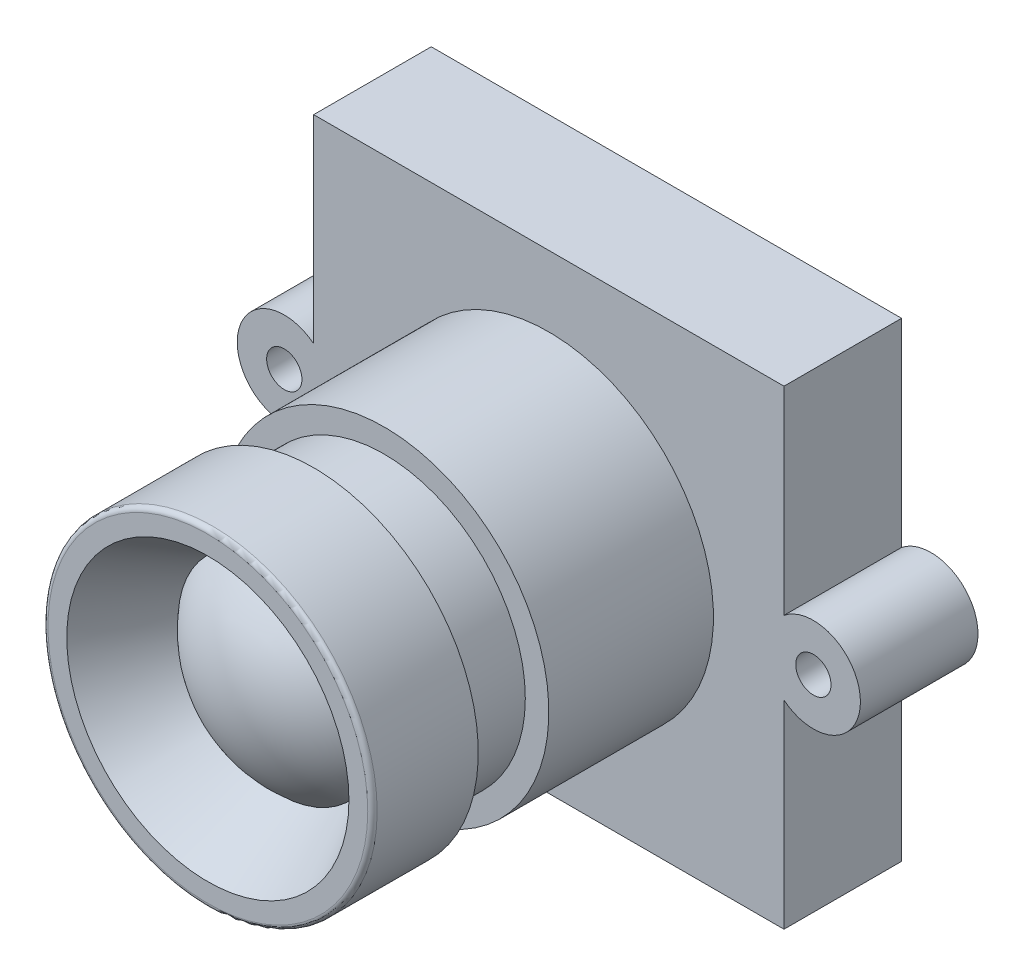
ISO-10303-21;
HEADER;
FILE_DESCRIPTION(('STEP AP214'),'2;1');
FILE_NAME('part.step','',(''),(''),'','','');
FILE_SCHEMA(('AUTOMOTIVE_DESIGN { 1 0 10303 214 1 1 1 1 }'));
ENDSEC;
DATA;
#1=APPLICATION_CONTEXT('core data for automotive mechanical design processes');
#2=APPLICATION_PROTOCOL_DEFINITION('international standard','automotive_design',2000,#1);
#3=PRODUCT_CONTEXT('',#1,'mechanical');
#4=PRODUCT('Part','Part','',(#3));
#5=PRODUCT_RELATED_PRODUCT_CATEGORY('part','',(#4));
#6=PRODUCT_DEFINITION_FORMATION('','',#4);
#7=PRODUCT_DEFINITION_CONTEXT('part definition',#1,'design');
#8=PRODUCT_DEFINITION('design','',#6,#7);
#9=PRODUCT_DEFINITION_SHAPE('','',#8);
#10=(LENGTH_UNIT() NAMED_UNIT(*) SI_UNIT(.MILLI.,.METRE.));
#11=(NAMED_UNIT(*) PLANE_ANGLE_UNIT() SI_UNIT($,.RADIAN.));
#12=(NAMED_UNIT(*) SI_UNIT($,.STERADIAN.) SOLID_ANGLE_UNIT());
#13=UNCERTAINTY_MEASURE_WITH_UNIT(LENGTH_MEASURE(1.E-05),#10,'distance_accuracy_value','');
#14=(GEOMETRIC_REPRESENTATION_CONTEXT(3) GLOBAL_UNCERTAINTY_ASSIGNED_CONTEXT((#13)) GLOBAL_UNIT_ASSIGNED_CONTEXT((#10,
#11,#12)) REPRESENTATION_CONTEXT('',''));
#15=CARTESIAN_POINT('',(0.,0.,0.));
#16=DIRECTION('',(0.,0.,1.));
#17=DIRECTION('',(1.,0.,0.));
#18=AXIS2_PLACEMENT_3D('',#15,#16,#17);
#19=CARTESIAN_POINT('',(-10.,-10.,5.));
#20=DIRECTION('',(0.,0.,1.));
#21=DIRECTION('',(1.,0.,0.));
#22=AXIS2_PLACEMENT_3D('',#19,#20,#21);
#23=PLANE('',#22);
#24=CARTESIAN_POINT('',(0.,0.,5.));
#25=DIRECTION('',(0.,0.,1.));
#26=DIRECTION('',(1.,0.,0.));
#27=AXIS2_PLACEMENT_3D('',#24,#25,#26);
#28=CIRCLE('',#27,6.5);
#29=CARTESIAN_POINT('',(6.5,0.,5.));
#30=VERTEX_POINT('',#29);
#31=EDGE_CURVE('E398',#30,#30,#28,.F.);
#32=ORIENTED_EDGE('',*,*,#31,.T.);
#33=EDGE_LOOP('',(#32));
#34=FACE_BOUND('',#33,.T.);
#35=CARTESIAN_POINT('',(0.,0.,5.));
#36=DIRECTION('',(0.,0.,1.));
#37=DIRECTION('',(1.,0.,0.));
#38=AXIS2_PLACEMENT_3D('',#35,#36,#37);
#39=CIRCLE('',#38,6.);
#40=CARTESIAN_POINT('',(6.,0.,5.));
#41=VERTEX_POINT('',#40);
#42=EDGE_CURVE('E228',#41,#41,#39,.F.);
#43=ORIENTED_EDGE('',*,*,#42,.F.);
#44=EDGE_LOOP('',(#43));
#45=FACE_BOUND('',#44,.T.);
#46=ADVANCED_FACE('F33',(#34,#45),#23,.F.);
#47=CARTESIAN_POINT('',(0.,0.,19.5));
#48=DIRECTION('',(0.,0.,-1.));
#49=DIRECTION('',(-1.,0.,0.));
#50=AXIS2_PLACEMENT_3D('',#47,#48,#49);
#51=CYLINDRICAL_SURFACE('',#50,7.);
#52=CARTESIAN_POINT('',(0.,0.,5.));
#53=DIRECTION('',(0.,0.,1.));
#54=DIRECTION('',(1.,0.,0.));
#55=AXIS2_PLACEMENT_3D('',#52,#53,#54);
#56=CIRCLE('',#55,7.);
#57=CARTESIAN_POINT('',(-7.,0.,5.));
#58=VERTEX_POINT('',#57);
#59=EDGE_CURVE('E236',#58,#58,#56,.T.);
#60=CARTESIAN_POINT('',(0.,0.,12.));
#61=DIRECTION('',(0.,0.,1.));
#62=DIRECTION('',(1.,0.,0.));
#63=AXIS2_PLACEMENT_3D('',#60,#61,#62);
#64=CIRCLE('',#63,7.);
#65=CARTESIAN_POINT('',(-7.,0.,12.));
#66=VERTEX_POINT('',#65);
#67=EDGE_CURVE('E232',#66,#66,#64,.T.);
#68=CARTESIAN_POINT('',(-7.,0.,5.));
#69=CARTESIAN_POINT('',(-7.,0.,5.07291666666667));
#70=CARTESIAN_POINT('',(-7.,0.,5.14583333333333));
#71=CARTESIAN_POINT('',(-7.,0.,5.29166666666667));
#72=CARTESIAN_POINT('',(-7.,0.,5.36458333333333));
#73=CARTESIAN_POINT('',(-7.,0.,5.51041666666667));
#74=CARTESIAN_POINT('',(-7.,0.,5.58333333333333));
#75=CARTESIAN_POINT('',(-7.,0.,5.72916666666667));
#76=CARTESIAN_POINT('',(-7.,0.,5.80208333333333));
#77=CARTESIAN_POINT('',(-7.,0.,5.94791666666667));
#78=CARTESIAN_POINT('',(-7.,0.,6.02083333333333));
#79=CARTESIAN_POINT('',(-7.,0.,6.16666666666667));
#80=CARTESIAN_POINT('',(-7.,0.,6.23958333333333));
#81=CARTESIAN_POINT('',(-7.,0.,6.38541666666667));
#82=CARTESIAN_POINT('',(-7.,0.,6.45833333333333));
#83=CARTESIAN_POINT('',(-7.,0.,6.60416666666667));
#84=CARTESIAN_POINT('',(-7.,0.,6.67708333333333));
#85=CARTESIAN_POINT('',(-7.,0.,6.82291666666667));
#86=CARTESIAN_POINT('',(-7.,0.,6.89583333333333));
#87=CARTESIAN_POINT('',(-7.,0.,7.04166666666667));
#88=CARTESIAN_POINT('',(-7.,0.,7.11458333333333));
#89=CARTESIAN_POINT('',(-7.,0.,7.26041666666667));
#90=CARTESIAN_POINT('',(-7.,0.,7.33333333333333));
#91=CARTESIAN_POINT('',(-7.,0.,7.47916666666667));
#92=CARTESIAN_POINT('',(-7.,0.,7.55208333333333));
#93=CARTESIAN_POINT('',(-7.,0.,7.69791666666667));
#94=CARTESIAN_POINT('',(-7.,0.,7.77083333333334));
#95=CARTESIAN_POINT('',(-7.,0.,7.91666666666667));
#96=CARTESIAN_POINT('',(-7.,0.,7.98958333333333));
#97=CARTESIAN_POINT('',(-7.,0.,8.13541666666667));
#98=CARTESIAN_POINT('',(-7.,0.,8.20833333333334));
#99=CARTESIAN_POINT('',(-7.,0.,8.35416666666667));
#100=CARTESIAN_POINT('',(-7.,0.,8.42708333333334));
#101=CARTESIAN_POINT('',(-7.,0.,8.57291666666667));
#102=CARTESIAN_POINT('',(-7.,0.,8.64583333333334));
#103=CARTESIAN_POINT('',(-7.,0.,8.79166666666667));
#104=CARTESIAN_POINT('',(-7.,0.,8.86458333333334));
#105=CARTESIAN_POINT('',(-7.,0.,9.01041666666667));
#106=CARTESIAN_POINT('',(-7.,0.,9.08333333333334));
#107=CARTESIAN_POINT('',(-7.,0.,9.22916666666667));
#108=CARTESIAN_POINT('',(-7.,0.,9.30208333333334));
#109=CARTESIAN_POINT('',(-7.,0.,9.44791666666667));
#110=CARTESIAN_POINT('',(-7.,0.,9.52083333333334));
#111=CARTESIAN_POINT('',(-7.,0.,9.66666666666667));
#112=CARTESIAN_POINT('',(-7.,0.,9.73958333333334));
#113=CARTESIAN_POINT('',(-7.,0.,9.88541666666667));
#114=CARTESIAN_POINT('',(-7.,0.,9.95833333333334));
#115=CARTESIAN_POINT('',(-7.,0.,10.1041666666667));
#116=CARTESIAN_POINT('',(-7.,0.,10.1770833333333));
#117=CARTESIAN_POINT('',(-7.,0.,10.3229166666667));
#118=CARTESIAN_POINT('',(-7.,0.,10.3958333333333));
#119=CARTESIAN_POINT('',(-7.,0.,10.5416666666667));
#120=CARTESIAN_POINT('',(-7.,0.,10.6145833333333));
#121=CARTESIAN_POINT('',(-7.,0.,10.7604166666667));
#122=CARTESIAN_POINT('',(-7.,0.,10.8333333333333));
#123=CARTESIAN_POINT('',(-7.,0.,10.9791666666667));
#124=CARTESIAN_POINT('',(-7.,0.,11.0520833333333));
#125=CARTESIAN_POINT('',(-7.,0.,11.1979166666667));
#126=CARTESIAN_POINT('',(-7.,0.,11.2708333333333));
#127=CARTESIAN_POINT('',(-7.,0.,11.4166666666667));
#128=CARTESIAN_POINT('',(-7.,0.,11.4895833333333));
#129=CARTESIAN_POINT('',(-7.,0.,11.6354166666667));
#130=CARTESIAN_POINT('',(-7.,0.,11.7083333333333));
#131=CARTESIAN_POINT('',(-7.,0.,11.8541666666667));
#132=CARTESIAN_POINT('',(-7.,0.,11.9270833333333));
#133=CARTESIAN_POINT('',(-7.,0.,12.));
#134=B_SPLINE_CURVE_WITH_KNOTS('',3,(#68,#69,#70,#71,#72,#73,#74,#75,#76,#77,#78,#79,#80,#81,
#82,#83,#84,#85,#86,#87,#88,#89,#90,#91,#92,#93,#94,#95,#96,#97,#98,#99,#100,#101,#102,#103,
#104,#105,#106,#107,#108,#109,#110,#111,#112,#113,#114,#115,#116,#117,#118,#119,#120,#121,#122,
#123,#124,#125,#126,#127,#128,#129,#130,#131,#132,#133),.UNSPECIFIED.,.F.,.F.,(4,2,2,2,2,2,2,2,
2,2,2,2,2,2,2,2,2,2,2,2,2,2,2,2,2,2,2,2,2,2,2,2,4),(0.,0.21875,0.4375,0.656250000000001,
0.875000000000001,1.09375,1.3125,1.53125,1.75,1.96875,2.1875,2.40625,2.625,2.84375,3.0625,
3.28125,3.5,3.71875,3.9375,4.15625,4.375,4.59375,4.8125,5.03125,5.25,5.46875,5.6875,5.90625,
6.125,6.34375,6.5625,6.78125,7.),.UNSPECIFIED.);
#135=EDGE_CURVE('BSEAM262',#58,#66,#134,.T.);
#136=ORIENTED_EDGE('',*,*,#59,.T.);
#137=ORIENTED_EDGE('',*,*,#67,.F.);
#138=ORIENTED_EDGE('',*,*,#135,.T.);
#139=ORIENTED_EDGE('',*,*,#135,.F.);
#140=EDGE_LOOP('',(#136,#138,#137,#139));
#141=FACE_BOUND('',#140,.T.);
#142=ADVANCED_FACE('F262',(#141),#51,.T.);
#143=CARTESIAN_POINT('',(-10.,-10.,5.));
#144=DIRECTION('',(0.,0.,1.));
#145=DIRECTION('',(1.,0.,0.));
#146=AXIS2_PLACEMENT_3D('',#143,#144,#145);
#147=PLANE('',#146);
#148=CARTESIAN_POINT('',(-11.25,0.,5.));
#149=DIRECTION('',(0.,0.,-1.));
#150=DIRECTION('',(-1.,0.,0.));
#151=AXIS2_PLACEMENT_3D('',#148,#149,#150);
#152=CIRCLE('',#151,0.75);
#153=CARTESIAN_POINT('',(-12.,0.,5.));
#154=VERTEX_POINT('',#153);
#155=EDGE_CURVE('E154',#154,#154,#152,.T.);
#156=ORIENTED_EDGE('',*,*,#155,.T.);
#157=EDGE_LOOP('',(#156));
#158=FACE_BOUND('',#157,.T.);
#159=CARTESIAN_POINT('',(11.25,0.,5.));
#160=DIRECTION('',(0.,0.,1.));
#161=DIRECTION('',(1.,0.,0.));
#162=AXIS2_PLACEMENT_3D('',#159,#160,#161);
#163=CIRCLE('',#162,0.75);
#164=CARTESIAN_POINT('',(12.,0.,5.));
#165=VERTEX_POINT('',#164);
#166=EDGE_CURVE('E144',#165,#165,#163,.T.);
#167=ORIENTED_EDGE('',*,*,#166,.F.);
#168=EDGE_LOOP('',(#167));
#169=FACE_BOUND('',#168,.T.);
#170=DIRECTION('',(0.,-1.,0.));
#171=VECTOR('',#170,1.);
#172=CARTESIAN_POINT('',(-10.,10.,5.));
#173=LINE('',#172,#171);
#174=CARTESIAN_POINT('',(-10.,10.,5.));
#175=VERTEX_POINT('',#174);
#176=CARTESIAN_POINT('',(-10.,1.5612494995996,5.));
#177=VERTEX_POINT('',#176);
#178=EDGE_CURVE('E207',#175,#177,#173,.T.);
#179=ORIENTED_EDGE('',*,*,#178,.T.);
#180=CARTESIAN_POINT('',(-11.25,0.,5.));
#181=DIRECTION('',(0.,0.,-1.));
#182=DIRECTION('',(-1.,0.,0.));
#183=AXIS2_PLACEMENT_3D('',#180,#181,#182);
#184=CIRCLE('',#183,2.);
#185=CARTESIAN_POINT('',(-10.,-1.5612494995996,5.));
#186=VERTEX_POINT('',#185);
#187=EDGE_CURVE('E141',#186,#177,#184,.T.);
#188=ORIENTED_EDGE('',*,*,#187,.F.);
#189=CARTESIAN_POINT('',(-10.,-10.,5.));
#190=VERTEX_POINT('',#189);
#191=EDGE_CURVE('E48',#186,#190,#173,.T.);
#192=ORIENTED_EDGE('',*,*,#191,.T.);
#193=DIRECTION('',(1.,0.,0.));
#194=VECTOR('',#193,1.);
#195=CARTESIAN_POINT('',(-10.,-10.,5.));
#196=LINE('',#195,#194);
#197=CARTESIAN_POINT('',(10.,-10.,5.));
#198=VERTEX_POINT('',#197);
#199=EDGE_CURVE('E209',#190,#198,#196,.T.);
#200=ORIENTED_EDGE('',*,*,#199,.T.);
#201=DIRECTION('',(0.,1.,0.));
#202=VECTOR('',#201,1.);
#203=CARTESIAN_POINT('',(10.,10.,5.));
#204=LINE('',#203,#202);
#205=CARTESIAN_POINT('',(10.,-1.5612494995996,5.));
#206=VERTEX_POINT('',#205);
#207=EDGE_CURVE('E212',#198,#206,#204,.T.);
#208=ORIENTED_EDGE('',*,*,#207,.T.);
#209=CARTESIAN_POINT('',(11.25,0.,5.));
#210=DIRECTION('',(0.,0.,1.));
#211=DIRECTION('',(1.,0.,0.));
#212=AXIS2_PLACEMENT_3D('',#209,#210,#211);
#213=CIRCLE('',#212,2.);
#214=CARTESIAN_POINT('',(10.,1.5612494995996,5.));
#215=VERTEX_POINT('',#214);
#216=EDGE_CURVE('E158',#206,#215,#213,.T.);
#217=ORIENTED_EDGE('',*,*,#216,.T.);
#218=CARTESIAN_POINT('',(10.,10.,5.));
#219=VERTEX_POINT('',#218);
#220=EDGE_CURVE('E211',#215,#219,#204,.T.);
#221=ORIENTED_EDGE('',*,*,#220,.T.);
#222=DIRECTION('',(-1.,0.,0.));
#223=VECTOR('',#222,1.);
#224=CARTESIAN_POINT('',(-10.,10.,5.));
#225=LINE('',#224,#223);
#226=EDGE_CURVE('E215',#219,#175,#225,.T.);
#227=ORIENTED_EDGE('',*,*,#226,.T.);
#228=EDGE_LOOP('',(#179,#188,#192,#200,#208,#217,#221,#227));
#229=FACE_BOUND('',#228,.T.);
#230=ORIENTED_EDGE('',*,*,#59,.F.);
#231=EDGE_LOOP('',(#230));
#232=FACE_BOUND('',#231,.T.);
#233=ADVANCED_FACE('F268',(#158,#169,#229,#232),#147,.T.);
#234=CARTESIAN_POINT('',(-10.,-10.,0.));
#235=DIRECTION('',(0.,0.,1.));
#236=DIRECTION('',(1.,0.,0.));
#237=AXIS2_PLACEMENT_3D('',#234,#235,#236);
#238=PLANE('',#237);
#239=DIRECTION('',(0.,-1.,0.));
#240=VECTOR('',#239,1.);
#241=CARTESIAN_POINT('',(-10.,10.,0.));
#242=LINE('',#241,#240);
#243=CARTESIAN_POINT('',(-10.,10.,0.));
#244=VERTEX_POINT('',#243);
#245=CARTESIAN_POINT('',(-10.,1.5612494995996,0.));
#246=VERTEX_POINT('',#245);
#247=EDGE_CURVE('E133',#244,#246,#242,.T.);
#248=ORIENTED_EDGE('',*,*,#247,.F.);
#249=DIRECTION('',(-1.,0.,0.));
#250=VECTOR('',#249,1.);
#251=CARTESIAN_POINT('',(-10.,10.,0.));
#252=LINE('',#251,#250);
#253=CARTESIAN_POINT('',(10.,10.,0.));
#254=VERTEX_POINT('',#253);
#255=EDGE_CURVE('E205',#254,#244,#252,.T.);
#256=ORIENTED_EDGE('',*,*,#255,.F.);
#257=DIRECTION('',(0.,1.,0.));
#258=VECTOR('',#257,1.);
#259=CARTESIAN_POINT('',(10.,10.,0.));
#260=LINE('',#259,#258);
#261=CARTESIAN_POINT('',(10.,1.5612494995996,0.));
#262=VERTEX_POINT('',#261);
#263=EDGE_CURVE('E202',#262,#254,#260,.T.);
#264=ORIENTED_EDGE('',*,*,#263,.F.);
#265=CARTESIAN_POINT('',(11.25,0.,0.));
#266=DIRECTION('',(0.,0.,1.));
#267=DIRECTION('',(1.,0.,0.));
#268=AXIS2_PLACEMENT_3D('',#265,#266,#267);
#269=CIRCLE('',#268,2.);
#270=CARTESIAN_POINT('',(10.,-1.5612494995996,0.));
#271=VERTEX_POINT('',#270);
#272=EDGE_CURVE('E159',#262,#271,#269,.F.);
#273=ORIENTED_EDGE('',*,*,#272,.T.);
#274=CARTESIAN_POINT('',(10.,-10.,0.));
#275=VERTEX_POINT('',#274);
#276=EDGE_CURVE('E203',#275,#271,#260,.T.);
#277=ORIENTED_EDGE('',*,*,#276,.F.);
#278=DIRECTION('',(1.,0.,0.));
#279=VECTOR('',#278,1.);
#280=CARTESIAN_POINT('',(-10.,-10.,0.));
#281=LINE('',#280,#279);
#282=CARTESIAN_POINT('',(-10.,-10.,0.));
#283=VERTEX_POINT('',#282);
#284=EDGE_CURVE('E131',#283,#275,#281,.T.);
#285=ORIENTED_EDGE('',*,*,#284,.F.);
#286=CARTESIAN_POINT('',(-10.,-1.5612494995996,0.));
#287=VERTEX_POINT('',#286);
#288=EDGE_CURVE('E124',#287,#283,#242,.T.);
#289=ORIENTED_EDGE('',*,*,#288,.F.);
#290=CARTESIAN_POINT('',(-11.25,0.,0.));
#291=DIRECTION('',(0.,0.,1.));
#292=DIRECTION('',(1.,0.,0.));
#293=AXIS2_PLACEMENT_3D('',#290,#291,#292);
#294=CIRCLE('',#293,2.);
#295=EDGE_CURVE('E129',#246,#287,#294,.T.);
#296=ORIENTED_EDGE('',*,*,#295,.F.);
#297=EDGE_LOOP('',(#248,#256,#264,#273,#277,#285,#289,#296));
#298=FACE_BOUND('',#297,.T.);
#299=DIRECTION('',(-1.,0.,0.));
#300=VECTOR('',#299,1.);
#301=CARTESIAN_POINT('',(-10.,9.,0.));
#302=LINE('',#301,#300);
#303=CARTESIAN_POINT('',(9.,9.,0.));
#304=VERTEX_POINT('',#303);
#305=CARTESIAN_POINT('',(-9.,9.,0.));
#306=VERTEX_POINT('',#305);
#307=EDGE_CURVE('E177',#304,#306,#302,.T.);
#308=ORIENTED_EDGE('',*,*,#307,.T.);
#309=DIRECTION('',(0.,-1.,0.));
#310=VECTOR('',#309,1.);
#311=CARTESIAN_POINT('',(-9.,10.,0.));
#312=LINE('',#311,#310);
#313=CARTESIAN_POINT('',(-9.,-9.,0.));
#314=VERTEX_POINT('',#313);
#315=EDGE_CURVE('E162',#306,#314,#312,.T.);
#316=ORIENTED_EDGE('',*,*,#315,.T.);
#317=DIRECTION('',(1.,0.,0.));
#318=VECTOR('',#317,1.);
#319=CARTESIAN_POINT('',(-10.,-9.,0.));
#320=LINE('',#319,#318);
#321=CARTESIAN_POINT('',(9.,-9.,0.));
#322=VERTEX_POINT('',#321);
#323=EDGE_CURVE('E192',#314,#322,#320,.T.);
#324=ORIENTED_EDGE('',*,*,#323,.T.);
#325=DIRECTION('',(0.,1.,0.));
#326=VECTOR('',#325,1.);
#327=CARTESIAN_POINT('',(9.,10.,0.));
#328=LINE('',#327,#326);
#329=EDGE_CURVE('E196',#322,#304,#328,.T.);
#330=ORIENTED_EDGE('',*,*,#329,.T.);
#331=EDGE_LOOP('',(#308,#316,#324,#330));
#332=FACE_BOUND('',#331,.T.);
#333=CARTESIAN_POINT('',(11.25,0.,0.));
#334=DIRECTION('',(0.,0.,1.));
#335=DIRECTION('',(1.,0.,0.));
#336=AXIS2_PLACEMENT_3D('',#333,#334,#335);
#337=CIRCLE('',#336,0.75);
#338=CARTESIAN_POINT('',(12.,0.,0.));
#339=VERTEX_POINT('',#338);
#340=EDGE_CURVE('E147',#339,#339,#337,.F.);
#341=ORIENTED_EDGE('',*,*,#340,.F.);
#342=EDGE_LOOP('',(#341));
#343=FACE_BOUND('',#342,.T.);
#344=CARTESIAN_POINT('',(-11.25,0.,0.));
#345=DIRECTION('',(0.,0.,1.));
#346=DIRECTION('',(1.,0.,0.));
#347=AXIS2_PLACEMENT_3D('',#344,#345,#346);
#348=CIRCLE('',#347,0.75);
#349=CARTESIAN_POINT('',(-10.5,0.,0.));
#350=VERTEX_POINT('',#349);
#351=EDGE_CURVE('E152',#350,#350,#348,.T.);
#352=ORIENTED_EDGE('',*,*,#351,.T.);
#353=EDGE_LOOP('',(#352));
#354=FACE_BOUND('',#353,.T.);
#355=ADVANCED_FACE('F126',(#298,#332,#343,#354),#238,.F.);
#356=CARTESIAN_POINT('',(-10.,10.,5.));
#357=DIRECTION('',(1.,0.,0.));
#358=DIRECTION('',(0.,1.,0.));
#359=AXIS2_PLACEMENT_3D('',#356,#357,#358);
#360=PLANE('',#359);
#361=DIRECTION('',(0.,0.,1.));
#362=VECTOR('',#361,1.);
#363=CARTESIAN_POINT('',(-10.,1.5612494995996,-5.15388203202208));
#364=LINE('',#363,#362);
#365=EDGE_CURVE('E56',#246,#177,#364,.T.);
#366=ORIENTED_EDGE('',*,*,#365,.T.);
#367=ORIENTED_EDGE('',*,*,#178,.F.);
#368=DIRECTION('',(0.,0.,-1.));
#369=VECTOR('',#368,1.);
#370=CARTESIAN_POINT('',(-10.,10.,5.));
#371=LINE('',#370,#369);
#372=EDGE_CURVE('E217',#175,#244,#371,.T.);
#373=ORIENTED_EDGE('',*,*,#372,.T.);
#374=ORIENTED_EDGE('',*,*,#247,.T.);
#375=EDGE_LOOP('',(#366,#367,#373,#374));
#376=FACE_BOUND('',#375,.T.);
#377=ADVANCED_FACE('F335',(#376),#360,.F.);
#378=DIRECTION('',(0.,0.,1.));
#379=VECTOR('',#378,1.);
#380=CARTESIAN_POINT('',(-10.,-1.5612494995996,-5.15388203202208));
#381=LINE('',#380,#379);
#382=EDGE_CURVE('E136',#287,#186,#381,.T.);
#383=ORIENTED_EDGE('',*,*,#382,.F.);
#384=ORIENTED_EDGE('',*,*,#288,.T.);
#385=DIRECTION('',(0.,0.,-1.));
#386=VECTOR('',#385,1.);
#387=CARTESIAN_POINT('',(-10.,-10.,5.));
#388=LINE('',#387,#386);
#389=EDGE_CURVE('E226',#190,#283,#388,.T.);
#390=ORIENTED_EDGE('',*,*,#389,.F.);
#391=ORIENTED_EDGE('',*,*,#191,.F.);
#392=EDGE_LOOP('',(#383,#384,#390,#391));
#393=FACE_BOUND('',#392,.T.);
#394=ADVANCED_FACE('F137',(#393),#360,.F.);
#395=CARTESIAN_POINT('',(10.,10.,5.));
#396=DIRECTION('',(-1.,0.,0.));
#397=DIRECTION('',(0.,-1.,0.));
#398=AXIS2_PLACEMENT_3D('',#395,#396,#397);
#399=PLANE('',#398);
#400=ORIENTED_EDGE('',*,*,#276,.T.);
#401=DIRECTION('',(0.,0.,1.));
#402=VECTOR('',#401,1.);
#403=CARTESIAN_POINT('',(10.,-1.5612494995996,-5.15388203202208));
#404=LINE('',#403,#402);
#405=EDGE_CURVE('E163',#271,#206,#404,.T.);
#406=ORIENTED_EDGE('',*,*,#405,.T.);
#407=ORIENTED_EDGE('',*,*,#207,.F.);
#408=DIRECTION('',(0.,0.,-1.));
#409=VECTOR('',#408,1.);
#410=CARTESIAN_POINT('',(10.,-10.,5.));
#411=LINE('',#410,#409);
#412=EDGE_CURVE('E223',#198,#275,#411,.T.);
#413=ORIENTED_EDGE('',*,*,#412,.T.);
#414=EDGE_LOOP('',(#400,#406,#407,#413));
#415=FACE_BOUND('',#414,.T.);
#416=ADVANCED_FACE('F347',(#415),#399,.F.);
#417=CARTESIAN_POINT('',(-10.,-10.,5.));
#418=DIRECTION('',(0.,1.,0.));
#419=DIRECTION('',(0.,0.,1.));
#420=AXIS2_PLACEMENT_3D('',#417,#418,#419);
#421=PLANE('',#420);
#422=ORIENTED_EDGE('',*,*,#284,.T.);
#423=ORIENTED_EDGE('',*,*,#412,.F.);
#424=ORIENTED_EDGE('',*,*,#199,.F.);
#425=ORIENTED_EDGE('',*,*,#389,.T.);
#426=EDGE_LOOP('',(#422,#423,#424,#425));
#427=FACE_BOUND('',#426,.T.);
#428=ADVANCED_FACE('F345',(#427),#421,.F.);
#429=ORIENTED_EDGE('',*,*,#220,.F.);
#430=DIRECTION('',(0.,0.,1.));
#431=VECTOR('',#430,1.);
#432=CARTESIAN_POINT('',(10.,1.5612494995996,-5.15388203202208));
#433=LINE('',#432,#431);
#434=EDGE_CURVE('E166',#262,#215,#433,.T.);
#435=ORIENTED_EDGE('',*,*,#434,.F.);
#436=ORIENTED_EDGE('',*,*,#263,.T.);
#437=DIRECTION('',(0.,0.,-1.));
#438=VECTOR('',#437,1.);
#439=CARTESIAN_POINT('',(10.,10.,5.));
#440=LINE('',#439,#438);
#441=EDGE_CURVE('E220',#219,#254,#440,.T.);
#442=ORIENTED_EDGE('',*,*,#441,.F.);
#443=EDGE_LOOP('',(#429,#435,#436,#442));
#444=FACE_BOUND('',#443,.T.);
#445=ADVANCED_FACE('F341',(#444),#399,.F.);
#446=CARTESIAN_POINT('',(-10.,10.,5.));
#447=DIRECTION('',(0.,-1.,0.));
#448=DIRECTION('',(0.,0.,-1.));
#449=AXIS2_PLACEMENT_3D('',#446,#447,#448);
#450=PLANE('',#449);
#451=ORIENTED_EDGE('',*,*,#255,.T.);
#452=ORIENTED_EDGE('',*,*,#372,.F.);
#453=ORIENTED_EDGE('',*,*,#226,.F.);
#454=ORIENTED_EDGE('',*,*,#441,.T.);
#455=EDGE_LOOP('',(#451,#452,#453,#454));
#456=FACE_BOUND('',#455,.T.);
#457=ADVANCED_FACE('F317',(#456),#450,.F.);
#458=CARTESIAN_POINT('',(-9.,10.,5.));
#459=DIRECTION('',(1.,0.,0.));
#460=DIRECTION('',(0.,1.,0.));
#461=AXIS2_PLACEMENT_3D('',#458,#459,#460);
#462=PLANE('',#461);
#463=ORIENTED_EDGE('',*,*,#315,.F.);
#464=DIRECTION('',(0.,0.,-1.));
#465=VECTOR('',#464,1.);
#466=CARTESIAN_POINT('',(-9.,9.,5.));
#467=LINE('',#466,#465);
#468=CARTESIAN_POINT('',(-9.,9.,4.));
#469=VERTEX_POINT('',#468);
#470=EDGE_CURVE('E178',#469,#306,#467,.T.);
#471=ORIENTED_EDGE('',*,*,#470,.F.);
#472=DIRECTION('',(0.,-1.,0.));
#473=VECTOR('',#472,1.);
#474=CARTESIAN_POINT('',(-9.,10.,4.));
#475=LINE('',#474,#473);
#476=CARTESIAN_POINT('',(-9.,-9.,4.));
#477=VERTEX_POINT('',#476);
#478=EDGE_CURVE('E173',#469,#477,#475,.T.);
#479=ORIENTED_EDGE('',*,*,#478,.T.);
#480=DIRECTION('',(0.,0.,-1.));
#481=VECTOR('',#480,1.);
#482=CARTESIAN_POINT('',(-9.,-9.,5.));
#483=LINE('',#482,#481);
#484=EDGE_CURVE('E134',#477,#314,#483,.T.);
#485=ORIENTED_EDGE('',*,*,#484,.T.);
#486=EDGE_LOOP('',(#463,#471,#479,#485));
#487=FACE_BOUND('',#486,.T.);
#488=ADVANCED_FACE('F313',(#487),#462,.T.);
#489=CARTESIAN_POINT('',(-10.,-9.,5.));
#490=DIRECTION('',(0.,1.,0.));
#491=DIRECTION('',(0.,0.,1.));
#492=AXIS2_PLACEMENT_3D('',#489,#490,#491);
#493=PLANE('',#492);
#494=ORIENTED_EDGE('',*,*,#323,.F.);
#495=ORIENTED_EDGE('',*,*,#484,.F.);
#496=DIRECTION('',(1.,0.,0.));
#497=VECTOR('',#496,1.);
#498=CARTESIAN_POINT('',(-10.,-9.,4.));
#499=LINE('',#498,#497);
#500=CARTESIAN_POINT('',(9.,-9.,4.));
#501=VERTEX_POINT('',#500);
#502=EDGE_CURVE('E176',#477,#501,#499,.T.);
#503=ORIENTED_EDGE('',*,*,#502,.T.);
#504=DIRECTION('',(0.,0.,-1.));
#505=VECTOR('',#504,1.);
#506=CARTESIAN_POINT('',(9.,-9.,5.));
#507=LINE('',#506,#505);
#508=EDGE_CURVE('E172',#501,#322,#507,.T.);
#509=ORIENTED_EDGE('',*,*,#508,.T.);
#510=EDGE_LOOP('',(#494,#495,#503,#509));
#511=FACE_BOUND('',#510,.T.);
#512=ADVANCED_FACE('F316',(#511),#493,.T.);
#513=CARTESIAN_POINT('',(9.,10.,5.));
#514=DIRECTION('',(-1.,0.,0.));
#515=DIRECTION('',(0.,-1.,0.));
#516=AXIS2_PLACEMENT_3D('',#513,#514,#515);
#517=PLANE('',#516);
#518=ORIENTED_EDGE('',*,*,#329,.F.);
#519=ORIENTED_EDGE('',*,*,#508,.F.);
#520=DIRECTION('',(0.,1.,0.));
#521=VECTOR('',#520,1.);
#522=CARTESIAN_POINT('',(9.,10.,4.));
#523=LINE('',#522,#521);
#524=CARTESIAN_POINT('',(9.,9.,4.));
#525=VERTEX_POINT('',#524);
#526=EDGE_CURVE('E185',#501,#525,#523,.T.);
#527=ORIENTED_EDGE('',*,*,#526,.T.);
#528=DIRECTION('',(0.,0.,-1.));
#529=VECTOR('',#528,1.);
#530=CARTESIAN_POINT('',(9.,9.,5.));
#531=LINE('',#530,#529);
#532=EDGE_CURVE('E180',#525,#304,#531,.T.);
#533=ORIENTED_EDGE('',*,*,#532,.T.);
#534=EDGE_LOOP('',(#518,#519,#527,#533));
#535=FACE_BOUND('',#534,.T.);
#536=ADVANCED_FACE('F321',(#535),#517,.T.);
#537=CARTESIAN_POINT('',(-10.,9.,5.));
#538=DIRECTION('',(0.,-1.,0.));
#539=DIRECTION('',(0.,0.,-1.));
#540=AXIS2_PLACEMENT_3D('',#537,#538,#539);
#541=PLANE('',#540);
#542=ORIENTED_EDGE('',*,*,#307,.F.);
#543=ORIENTED_EDGE('',*,*,#532,.F.);
#544=DIRECTION('',(-1.,0.,0.));
#545=VECTOR('',#544,1.);
#546=CARTESIAN_POINT('',(-10.,9.,4.));
#547=LINE('',#546,#545);
#548=EDGE_CURVE('E181',#525,#469,#547,.T.);
#549=ORIENTED_EDGE('',*,*,#548,.T.);
#550=ORIENTED_EDGE('',*,*,#470,.T.);
#551=EDGE_LOOP('',(#542,#543,#549,#550));
#552=FACE_BOUND('',#551,.T.);
#553=ADVANCED_FACE('F325',(#552),#541,.T.);
#554=CARTESIAN_POINT('',(-10.,-10.,4.));
#555=DIRECTION('',(0.,0.,1.));
#556=DIRECTION('',(1.,0.,0.));
#557=AXIS2_PLACEMENT_3D('',#554,#555,#556);
#558=PLANE('',#557);
#559=CARTESIAN_POINT('',(0.,0.,4.));
#560=DIRECTION('',(0.,0.,-1.));
#561=DIRECTION('',(-1.,0.,0.));
#562=AXIS2_PLACEMENT_3D('',#559,#560,#561);
#563=CIRCLE('',#562,6.5);
#564=CARTESIAN_POINT('',(-6.5,0.,4.));
#565=VERTEX_POINT('',#564);
#566=EDGE_CURVE('E400',#565,#565,#563,.T.);
#567=ORIENTED_EDGE('',*,*,#566,.F.);
#568=EDGE_LOOP('',(#567));
#569=FACE_BOUND('',#568,.T.);
#570=ORIENTED_EDGE('',*,*,#478,.F.);
#571=ORIENTED_EDGE('',*,*,#548,.F.);
#572=ORIENTED_EDGE('',*,*,#526,.F.);
#573=ORIENTED_EDGE('',*,*,#502,.F.);
#574=EDGE_LOOP('',(#570,#571,#572,#573));
#575=FACE_BOUND('',#574,.T.);
#576=ADVANCED_FACE('F311',(#569,#575),#558,.F.);
#577=CARTESIAN_POINT('',(11.25,0.,-5.15388203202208));
#578=DIRECTION('',(0.,0.,1.));
#579=DIRECTION('',(1.,0.,0.));
#580=AXIS2_PLACEMENT_3D('',#577,#578,#579);
#581=CYLINDRICAL_SURFACE('',#580,2.);
#582=ORIENTED_EDGE('',*,*,#272,.F.);
#583=ORIENTED_EDGE('',*,*,#434,.T.);
#584=ORIENTED_EDGE('',*,*,#216,.F.);
#585=ORIENTED_EDGE('',*,*,#405,.F.);
#586=EDGE_LOOP('',(#582,#583,#584,#585));
#587=FACE_BOUND('',#586,.T.);
#588=ADVANCED_FACE('F307',(#587),#581,.T.);
#589=CARTESIAN_POINT('',(11.25,0.,-0.00100000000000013));
#590=DIRECTION('',(0.,0.,1.));
#591=DIRECTION('',(1.,0.,0.));
#592=AXIS2_PLACEMENT_3D('',#589,#590,#591);
#593=CYLINDRICAL_SURFACE('',#592,0.75);
#594=ORIENTED_EDGE('',*,*,#166,.T.);
#595=EDGE_LOOP('',(#594));
#596=FACE_BOUND('',#595,.T.);
#597=ORIENTED_EDGE('',*,*,#340,.T.);
#598=EDGE_LOOP('',(#597));
#599=FACE_BOUND('',#598,.T.);
#600=ADVANCED_FACE('F304',(#596,#599),#593,.F.);
#601=CARTESIAN_POINT('',(-11.25,0.,-5.15388203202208));
#602=DIRECTION('',(0.,0.,1.));
#603=DIRECTION('',(1.,0.,0.));
#604=AXIS2_PLACEMENT_3D('',#601,#602,#603);
#605=CYLINDRICAL_SURFACE('',#604,2.);
#606=ORIENTED_EDGE('',*,*,#365,.F.);
#607=ORIENTED_EDGE('',*,*,#295,.T.);
#608=ORIENTED_EDGE('',*,*,#382,.T.);
#609=ORIENTED_EDGE('',*,*,#187,.T.);
#610=EDGE_LOOP('',(#606,#607,#608,#609));
#611=FACE_BOUND('',#610,.T.);
#612=ADVANCED_FACE('F143',(#611),#605,.T.);
#613=CARTESIAN_POINT('',(-11.25,0.,-0.00100000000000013));
#614=DIRECTION('',(0.,0.,1.));
#615=DIRECTION('',(1.,0.,0.));
#616=AXIS2_PLACEMENT_3D('',#613,#614,#615);
#617=CYLINDRICAL_SURFACE('',#616,0.75);
#618=ORIENTED_EDGE('',*,*,#155,.F.);
#619=EDGE_LOOP('',(#618));
#620=FACE_BOUND('',#619,.T.);
#621=ORIENTED_EDGE('',*,*,#351,.F.);
#622=EDGE_LOOP('',(#621));
#623=FACE_BOUND('',#622,.T.);
#624=ADVANCED_FACE('F293',(#620,#623),#617,.F.);
#625=CARTESIAN_POINT('',(0.,0.,12.));
#626=DIRECTION('',(0.,0.,1.));
#627=DIRECTION('',(1.,0.,0.));
#628=AXIS2_PLACEMENT_3D('',#625,#626,#627);
#629=PLANE('',#628);
#630=CARTESIAN_POINT('',(0.,0.,12.));
#631=DIRECTION('',(0.,0.,1.));
#632=DIRECTION('',(1.,0.,0.));
#633=AXIS2_PLACEMENT_3D('',#630,#631,#632);
#634=CIRCLE('',#633,6.);
#635=CARTESIAN_POINT('',(6.,0.,12.));
#636=VERTEX_POINT('',#635);
#637=EDGE_CURVE('E233',#636,#636,#634,.T.);
#638=ORIENTED_EDGE('',*,*,#637,.F.);
#639=EDGE_LOOP('',(#638));
#640=FACE_BOUND('',#639,.T.);
#641=ORIENTED_EDGE('',*,*,#67,.T.);
#642=EDGE_LOOP('',(#641));
#643=FACE_BOUND('',#642,.T.);
#644=ADVANCED_FACE('F289',(#640,#643),#629,.T.);
#645=CARTESIAN_POINT('',(0.,0.,15.));
#646=DIRECTION('',(0.,0.,1.));
#647=DIRECTION('',(1.,0.,0.));
#648=AXIS2_PLACEMENT_3D('',#645,#646,#647);
#649=PLANE('',#648);
#650=CARTESIAN_POINT('',(0.,0.,15.));
#651=DIRECTION('',(0.,0.,1.));
#652=DIRECTION('',(1.,0.,0.));
#653=AXIS2_PLACEMENT_3D('',#650,#651,#652);
#654=CIRCLE('',#653,6.);
#655=CARTESIAN_POINT('',(6.,0.,15.));
#656=VERTEX_POINT('',#655);
#657=EDGE_CURVE('E240',#656,#656,#654,.T.);
#658=ORIENTED_EDGE('',*,*,#657,.T.);
#659=EDGE_LOOP('',(#658));
#660=FACE_BOUND('',#659,.T.);
#661=CARTESIAN_POINT('',(0.,0.,15.));
#662=DIRECTION('',(0.,0.,1.));
#663=DIRECTION('',(1.,0.,0.));
#664=AXIS2_PLACEMENT_3D('',#661,#662,#663);
#665=CIRCLE('',#664,7.);
#666=CARTESIAN_POINT('',(-7.,0.,15.));
#667=VERTEX_POINT('',#666);
#668=EDGE_CURVE('E229',#667,#667,#665,.T.);
#669=ORIENTED_EDGE('',*,*,#668,.F.);
#670=EDGE_LOOP('',(#669));
#671=FACE_BOUND('',#670,.T.);
#672=ADVANCED_FACE('F285',(#660,#671),#649,.F.);
#673=CARTESIAN_POINT('',(0.,0.,12.));
#674=DIRECTION('',(0.,0.,1.));
#675=DIRECTION('',(1.,0.,0.));
#676=AXIS2_PLACEMENT_3D('',#673,#674,#675);
#677=CYLINDRICAL_SURFACE('',#676,6.);
#678=ORIENTED_EDGE('',*,*,#637,.T.);
#679=EDGE_LOOP('',(#678));
#680=FACE_BOUND('',#679,.T.);
#681=ORIENTED_EDGE('',*,*,#657,.F.);
#682=EDGE_LOOP('',(#681));
#683=FACE_BOUND('',#682,.T.);
#684=ADVANCED_FACE('F282',(#680,#683),#677,.T.);
#685=CARTESIAN_POINT('',(0.,0.,19.5));
#686=DIRECTION('',(0.,0.,1.));
#687=DIRECTION('',(1.,0.,0.));
#688=AXIS2_PLACEMENT_3D('',#685,#686,#687);
#689=PLANE('',#688);
#690=CARTESIAN_POINT('',(0.,0.,19.5));
#691=DIRECTION('',(0.,0.,1.));
#692=DIRECTION('',(1.,0.,0.));
#693=AXIS2_PLACEMENT_3D('',#690,#691,#692);
#694=CIRCLE('',#693,6.8);
#695=CARTESIAN_POINT('',(6.8,0.,19.5));
#696=VERTEX_POINT('',#695);
#697=EDGE_CURVE('E41',#696,#696,#694,.T.);
#698=ORIENTED_EDGE('',*,*,#697,.T.);
#699=EDGE_LOOP('',(#698));
#700=FACE_BOUND('',#699,.T.);
#701=CARTESIAN_POINT('',(0.,0.,19.5));
#702=DIRECTION('',(0.,0.,1.));
#703=DIRECTION('',(1.,0.,0.));
#704=AXIS2_PLACEMENT_3D('',#701,#702,#703);
#705=CIRCLE('',#704,6.);
#706=CARTESIAN_POINT('',(6.,0.,19.5));
#707=VERTEX_POINT('',#706);
#708=EDGE_CURVE('E241',#707,#707,#705,.T.);
#709=ORIENTED_EDGE('',*,*,#708,.F.);
#710=EDGE_LOOP('',(#709));
#711=FACE_BOUND('',#710,.T.);
#712=ADVANCED_FACE('F246',(#700,#711),#689,.T.);
#713=CARTESIAN_POINT('',(0.,0.,19.3));
#714=DIRECTION('',(0.,0.,1.));
#715=DIRECTION('',(1.,0.,0.));
#716=AXIS2_PLACEMENT_3D('',#713,#714,#715);
#717=CIRCLE('',#716,7.);
#718=CARTESIAN_POINT('',(-7.,0.,19.3));
#719=VERTEX_POINT('',#718);
#720=EDGE_CURVE('E12',#719,#719,#717,.F.);
#721=CARTESIAN_POINT('',(-7.,0.,19.3));
#722=CARTESIAN_POINT('',(-7.,0.,19.2552083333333));
#723=CARTESIAN_POINT('',(-7.,0.,19.2104166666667));
#724=CARTESIAN_POINT('',(-7.,0.,19.1208333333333));
#725=CARTESIAN_POINT('',(-7.,0.,19.0760416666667));
#726=CARTESIAN_POINT('',(-7.,0.,18.9864583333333));
#727=CARTESIAN_POINT('',(-7.,0.,18.9416666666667));
#728=CARTESIAN_POINT('',(-7.,0.,18.8520833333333));
#729=CARTESIAN_POINT('',(-7.,0.,18.8072916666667));
#730=CARTESIAN_POINT('',(-7.,0.,18.7177083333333));
#731=CARTESIAN_POINT('',(-7.,0.,18.6729166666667));
#732=CARTESIAN_POINT('',(-7.,0.,18.5833333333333));
#733=CARTESIAN_POINT('',(-7.,0.,18.5385416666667));
#734=CARTESIAN_POINT('',(-7.,0.,18.4489583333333));
#735=CARTESIAN_POINT('',(-7.,0.,18.4041666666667));
#736=CARTESIAN_POINT('',(-7.,0.,18.3145833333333));
#737=CARTESIAN_POINT('',(-7.,0.,18.2697916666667));
#738=CARTESIAN_POINT('',(-7.,0.,18.1802083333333));
#739=CARTESIAN_POINT('',(-7.,0.,18.1354166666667));
#740=CARTESIAN_POINT('',(-7.,0.,18.0458333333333));
#741=CARTESIAN_POINT('',(-7.,0.,18.0010416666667));
#742=CARTESIAN_POINT('',(-7.,0.,17.9114583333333));
#743=CARTESIAN_POINT('',(-7.,0.,17.8666666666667));
#744=CARTESIAN_POINT('',(-7.,0.,17.7770833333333));
#745=CARTESIAN_POINT('',(-7.,0.,17.7322916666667));
#746=CARTESIAN_POINT('',(-7.,0.,17.6427083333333));
#747=CARTESIAN_POINT('',(-7.,0.,17.5979166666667));
#748=CARTESIAN_POINT('',(-7.,0.,17.5083333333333));
#749=CARTESIAN_POINT('',(-7.,0.,17.4635416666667));
#750=CARTESIAN_POINT('',(-7.,0.,17.3739583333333));
#751=CARTESIAN_POINT('',(-7.,0.,17.3291666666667));
#752=CARTESIAN_POINT('',(-7.,0.,17.2395833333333));
#753=CARTESIAN_POINT('',(-7.,0.,17.1947916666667));
#754=CARTESIAN_POINT('',(-7.,0.,17.1052083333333));
#755=CARTESIAN_POINT('',(-7.,0.,17.0604166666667));
#756=CARTESIAN_POINT('',(-7.,0.,16.9708333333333));
#757=CARTESIAN_POINT('',(-7.,0.,16.9260416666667));
#758=CARTESIAN_POINT('',(-7.,0.,16.8364583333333));
#759=CARTESIAN_POINT('',(-7.,0.,16.7916666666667));
#760=CARTESIAN_POINT('',(-7.,0.,16.7020833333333));
#761=CARTESIAN_POINT('',(-7.,0.,16.6572916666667));
#762=CARTESIAN_POINT('',(-7.,0.,16.5677083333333));
#763=CARTESIAN_POINT('',(-7.,0.,16.5229166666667));
#764=CARTESIAN_POINT('',(-7.,0.,16.4333333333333));
#765=CARTESIAN_POINT('',(-7.,0.,16.3885416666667));
#766=CARTESIAN_POINT('',(-7.,0.,16.2989583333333));
#767=CARTESIAN_POINT('',(-7.,0.,16.2541666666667));
#768=CARTESIAN_POINT('',(-7.,0.,16.1645833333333));
#769=CARTESIAN_POINT('',(-7.,0.,16.1197916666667));
#770=CARTESIAN_POINT('',(-7.,0.,16.0302083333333));
#771=CARTESIAN_POINT('',(-7.,0.,15.9854166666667));
#772=CARTESIAN_POINT('',(-7.,0.,15.8958333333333));
#773=CARTESIAN_POINT('',(-7.,0.,15.8510416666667));
#774=CARTESIAN_POINT('',(-7.,0.,15.7614583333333));
#775=CARTESIAN_POINT('',(-7.,0.,15.7166666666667));
#776=CARTESIAN_POINT('',(-7.,0.,15.6270833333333));
#777=CARTESIAN_POINT('',(-7.,0.,15.5822916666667));
#778=CARTESIAN_POINT('',(-7.,0.,15.4927083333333));
#779=CARTESIAN_POINT('',(-7.,0.,15.4479166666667));
#780=CARTESIAN_POINT('',(-7.,0.,15.3583333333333));
#781=CARTESIAN_POINT('',(-7.,0.,15.3135416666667));
#782=CARTESIAN_POINT('',(-7.,0.,15.2239583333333));
#783=CARTESIAN_POINT('',(-7.,0.,15.1791666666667));
#784=CARTESIAN_POINT('',(-7.,0.,15.0895833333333));
#785=CARTESIAN_POINT('',(-7.,0.,15.0447916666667));
#786=CARTESIAN_POINT('',(-7.,0.,15.));
#787=B_SPLINE_CURVE_WITH_KNOTS('',3,(#721,#722,#723,#724,#725,#726,#727,#728,#729,#730,#731,
#732,#733,#734,#735,#736,#737,#738,#739,#740,#741,#742,#743,#744,#745,#746,#747,#748,#749,#750,
#751,#752,#753,#754,#755,#756,#757,#758,#759,#760,#761,#762,#763,#764,#765,#766,#767,#768,#769,
#770,#771,#772,#773,#774,#775,#776,#777,#778,#779,#780,#781,#782,#783,#784,#785,#786),
.UNSPECIFIED.,.F.,.F.,(4,2,2,2,2,2,2,2,2,2,2,2,2,2,2,2,2,2,2,2,2,2,2,2,2,2,2,2,2,2,2,2,4),(0.,
0.134375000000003,0.268750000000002,0.403125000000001,0.5375,0.671875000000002,
0.806250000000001,0.940625,1.075,1.209375,1.34375,1.478125,1.6125,1.746875,1.88125,2.015625,
2.15,2.284375,2.41875,2.553125,2.6875,2.821875,2.95625,3.090625,3.225,3.359375,3.49375,3.628125,
3.7625,3.896875,4.03125,4.165625,4.3),.UNSPECIFIED.);
#788=EDGE_CURVE('BSEAM271',#719,#667,#787,.T.);
#789=ORIENTED_EDGE('',*,*,#720,.T.);
#790=ORIENTED_EDGE('',*,*,#668,.T.);
#791=ORIENTED_EDGE('',*,*,#788,.T.);
#792=ORIENTED_EDGE('',*,*,#788,.F.);
#793=EDGE_LOOP('',(#789,#791,#790,#792));
#794=FACE_BOUND('',#793,.T.);
#795=ADVANCED_FACE('F271',(#794),#51,.T.);
#796=CARTESIAN_POINT('',(0.,0.,19.5));
#797=DIRECTION('',(0.,0.,1.));
#798=DIRECTION('',(1.,0.,0.));
#799=AXIS2_PLACEMENT_3D('',#796,#797,#798);
#800=CONICAL_SURFACE('',#799,6.,0.5235987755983);
#801=CARTESIAN_POINT('',(0.,0.,16.5));
#802=DIRECTION('',(0.,0.,1.));
#803=DIRECTION('',(1.,0.,0.));
#804=AXIS2_PLACEMENT_3D('',#801,#802,#803);
#805=CIRCLE('',#804,4.26794919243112);
#806=CARTESIAN_POINT('',(4.26794919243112,0.,16.5));
#807=VERTEX_POINT('',#806);
#808=EDGE_CURVE('E237',#807,#807,#805,.T.);
#809=ORIENTED_EDGE('',*,*,#808,.F.);
#810=EDGE_LOOP('',(#809));
#811=FACE_BOUND('',#810,.T.);
#812=ORIENTED_EDGE('',*,*,#708,.T.);
#813=EDGE_LOOP('',(#812));
#814=FACE_BOUND('',#813,.T.);
#815=ADVANCED_FACE('F278',(#811,#814),#800,.F.);
#816=CARTESIAN_POINT('',(0.,0.,12.9461524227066));
#817=DIRECTION('',(0.,0.,1.));
#818=DIRECTION('',(1.,0.,0.));
#819=AXIS2_PLACEMENT_3D('',#816,#817,#818);
#820=SPHERICAL_SURFACE('',#819,5.55384757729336);
#821=ORIENTED_EDGE('',*,*,#808,.T.);
#822=EDGE_LOOP('',(#821));
#823=FACE_BOUND('',#822,.T.);
#824=ADVANCED_FACE('F35',(#823),#820,.T.);
#825=CARTESIAN_POINT('',(0.,0.,23.3847763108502));
#826=DIRECTION('',(0.,0.,-1.));
#827=DIRECTION('',(-1.,0.,0.));
#828=AXIS2_PLACEMENT_3D('',#825,#826,#827);
#829=CYLINDRICAL_SURFACE('',#828,6.5);
#830=ORIENTED_EDGE('',*,*,#566,.T.);
#831=EDGE_LOOP('',(#830));
#832=FACE_BOUND('',#831,.T.);
#833=ORIENTED_EDGE('',*,*,#31,.F.);
#834=EDGE_LOOP('',(#833));
#835=FACE_BOUND('',#834,.T.);
#836=ADVANCED_FACE('F276',(#832,#835),#829,.F.);
#837=CARTESIAN_POINT('',(0.,0.,4.5));
#838=DIRECTION('',(0.,0.,1.));
#839=DIRECTION('',(1.,0.,0.));
#840=AXIS2_PLACEMENT_3D('',#837,#838,#839);
#841=CYLINDRICAL_SURFACE('',#840,6.);
#842=CARTESIAN_POINT('',(0.,0.,4.5));
#843=DIRECTION('',(0.,0.,-1.));
#844=DIRECTION('',(-1.,0.,0.));
#845=AXIS2_PLACEMENT_3D('',#842,#843,#844);
#846=CIRCLE('',#845,6.);
#847=CARTESIAN_POINT('',(-6.,0.,4.5));
#848=VERTEX_POINT('',#847);
#849=EDGE_CURVE('E403',#848,#848,#846,.T.);
#850=ORIENTED_EDGE('',*,*,#849,.F.);
#851=EDGE_LOOP('',(#850));
#852=FACE_BOUND('',#851,.T.);
#853=ORIENTED_EDGE('',*,*,#42,.T.);
#854=EDGE_LOOP('',(#853));
#855=FACE_BOUND('',#854,.T.);
#856=ADVANCED_FACE('F419',(#852,#855),#841,.T.);
#857=CARTESIAN_POINT('',(0.,0.,4.5));
#858=DIRECTION('',(0.,0.,-1.));
#859=DIRECTION('',(-1.,0.,0.));
#860=AXIS2_PLACEMENT_3D('',#857,#858,#859);
#861=PLANE('',#860);
#862=CARTESIAN_POINT('',(0.,0.,4.5));
#863=DIRECTION('',(0.,0.,-1.));
#864=DIRECTION('',(-1.,0.,0.));
#865=AXIS2_PLACEMENT_3D('',#862,#863,#864);
#866=CIRCLE('',#865,3.);
#867=CARTESIAN_POINT('',(-3.,0.,4.5));
#868=VERTEX_POINT('',#867);
#869=EDGE_CURVE('E409',#868,#868,#866,.T.);
#870=ORIENTED_EDGE('',*,*,#869,.F.);
#871=EDGE_LOOP('',(#870));
#872=FACE_BOUND('',#871,.T.);
#873=ORIENTED_EDGE('',*,*,#849,.T.);
#874=EDGE_LOOP('',(#873));
#875=FACE_BOUND('',#874,.T.);
#876=ADVANCED_FACE('F416',(#872,#875),#861,.T.);
#877=CARTESIAN_POINT('',(0.,0.,4.5));
#878=DIRECTION('',(0.,0.,-1.));
#879=DIRECTION('',(-1.,0.,0.));
#880=AXIS2_PLACEMENT_3D('',#877,#878,#879);
#881=CONICAL_SURFACE('',#880,3.,0.5235987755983);
#882=CARTESIAN_POINT('',(0.,0.,6.));
#883=DIRECTION('',(0.,0.,-1.));
#884=DIRECTION('',(-1.,0.,0.));
#885=AXIS2_PLACEMENT_3D('',#882,#883,#884);
#886=CIRCLE('',#885,2.13397459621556);
#887=CARTESIAN_POINT('',(-2.13397459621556,0.,6.));
#888=VERTEX_POINT('',#887);
#889=EDGE_CURVE('E406',#888,#888,#886,.T.);
#890=ORIENTED_EDGE('',*,*,#889,.F.);
#891=EDGE_LOOP('',(#890));
#892=FACE_BOUND('',#891,.T.);
#893=ORIENTED_EDGE('',*,*,#869,.T.);
#894=EDGE_LOOP('',(#893));
#895=FACE_BOUND('',#894,.T.);
#896=ADVANCED_FACE('F257',(#892,#895),#881,.F.);
#897=CARTESIAN_POINT('',(0.,0.,6.));
#898=DIRECTION('',(0.,0.,-1.));
#899=DIRECTION('',(-1.,0.,0.));
#900=AXIS2_PLACEMENT_3D('',#897,#898,#899);
#901=PLANE('',#900);
#902=ORIENTED_EDGE('',*,*,#889,.T.);
#903=EDGE_LOOP('',(#902));
#904=FACE_BOUND('',#903,.T.);
#905=ADVANCED_FACE('F251',(#904),#901,.T.);
#906=CARTESIAN_POINT('',(0.,0.,19.3));
#907=DIRECTION('',(0.,0.,1.));
#908=DIRECTION('',(1.,0.,0.));
#909=AXIS2_PLACEMENT_3D('',#906,#907,#908);
#910=TOROIDAL_SURFACE('',#909,6.8,0.2);
#911=ORIENTED_EDGE('',*,*,#720,.F.);
#912=EDGE_LOOP('',(#911));
#913=FACE_BOUND('',#912,.T.);
#914=ORIENTED_EDGE('',*,*,#697,.F.);
#915=EDGE_LOOP('',(#914));
#916=FACE_BOUND('',#915,.T.);
#917=ADVANCED_FACE('F249',(#913,#916),#910,.T.);
#918=CLOSED_SHELL('',(#46,#142,#233,#355,#377,#394,#416,#428,#445,#457,#488,#512,#536,#553,#576,
#588,#600,#612,#624,#644,#672,#684,#712,#795,#815,#824,#836,#856,#876,#896,#905,#917));
#919=MANIFOLD_SOLID_BREP('B2',#918);
#920=ADVANCED_BREP_SHAPE_REPRESENTATION('',(#18,#919),#14);
#921=SHAPE_DEFINITION_REPRESENTATION(#9,#920);
ENDSEC;
END-ISO-10303-21;
